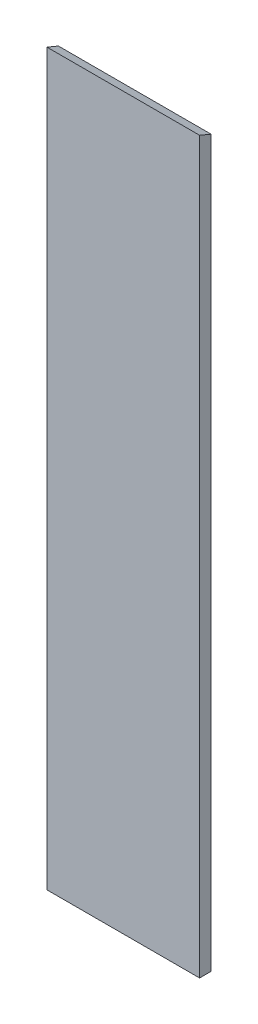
from build123d import *

# Parameters (mm, degrees)
ESQUISSE1_W             = 200
ESQUISSE1_H             = 956.2
BOSS_EXTRU_1_DEPTH      = 15
ENL_V_MAT_EXTRU_1_DEPTH = 519.463701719


with BuildPart() as part:
    # Esquisse1 → Boss.-Extru.1 (new body)
    with BuildSketch(Plane.XY):
        Rectangle(ESQUISSE1_W, ESQUISSE1_H)
    extrude(amount=BOSS_EXTRU_1_DEPTH)

    # Esquisse2 → Enl_v. mat.-Extru.1 (cut, through all)
    with BuildSketch(Plane(origin=(100, 0, 0), x_dir=(0, 0, -1), z_dir=(1, 0, 0))):
        Polygon((-15, 478.1), (0, 471.886796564), (0, 478.1), align=None)
    extrude(amount=-ENL_V_MAT_EXTRU_1_DEPTH, mode=Mode.SUBTRACT)


solid = part.part
